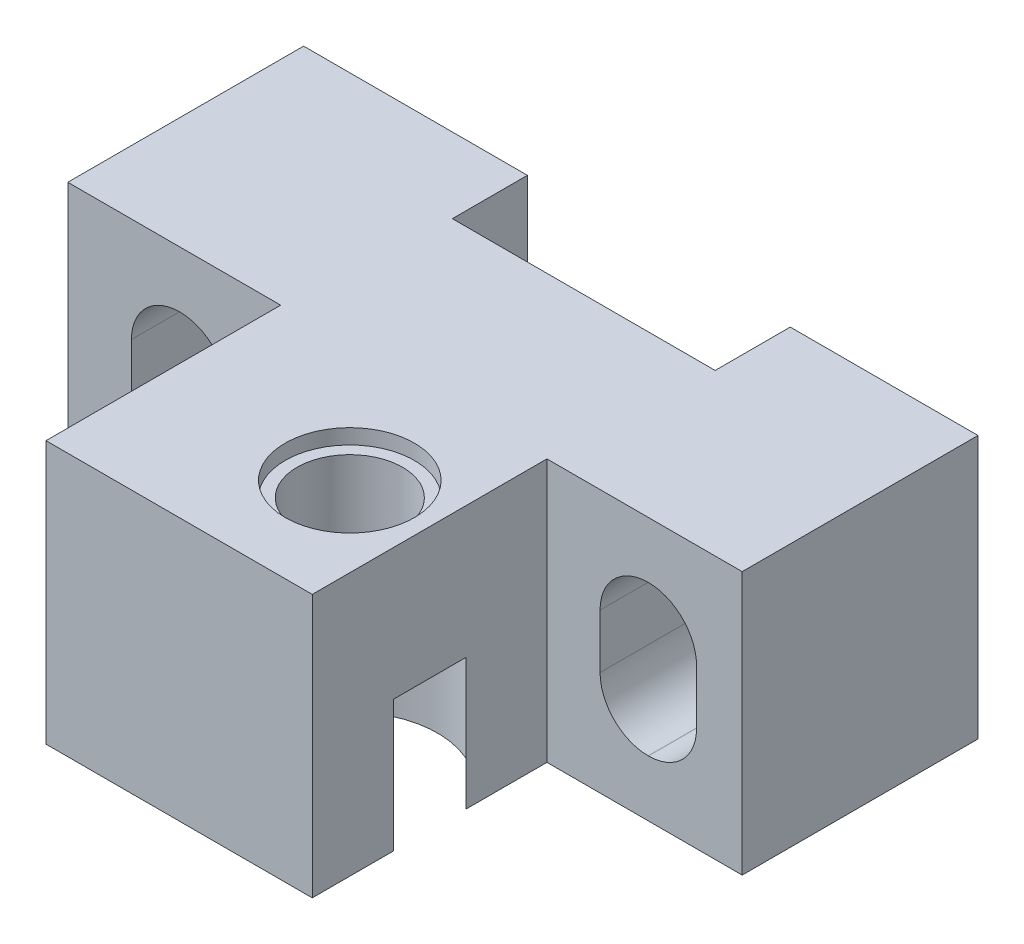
ISO-10303-21;
HEADER;
FILE_DESCRIPTION(('STEP AP214'),'2;1');
FILE_NAME('part.step','',(''),(''),'','','');
FILE_SCHEMA(('AUTOMOTIVE_DESIGN { 1 0 10303 214 1 1 1 1 }'));
ENDSEC;
DATA;
#1=APPLICATION_CONTEXT('core data for automotive mechanical design processes');
#2=APPLICATION_PROTOCOL_DEFINITION('international standard','automotive_design',2000,#1);
#3=PRODUCT_CONTEXT('',#1,'mechanical');
#4=PRODUCT('Part','Part','',(#3));
#5=PRODUCT_RELATED_PRODUCT_CATEGORY('part','',(#4));
#6=PRODUCT_DEFINITION_FORMATION('','',#4);
#7=PRODUCT_DEFINITION_CONTEXT('part definition',#1,'design');
#8=PRODUCT_DEFINITION('design','',#6,#7);
#9=PRODUCT_DEFINITION_SHAPE('','',#8);
#10=(LENGTH_UNIT() NAMED_UNIT(*) SI_UNIT(.MILLI.,.METRE.));
#11=(NAMED_UNIT(*) PLANE_ANGLE_UNIT() SI_UNIT($,.RADIAN.));
#12=(NAMED_UNIT(*) SI_UNIT($,.STERADIAN.) SOLID_ANGLE_UNIT());
#13=UNCERTAINTY_MEASURE_WITH_UNIT(LENGTH_MEASURE(1.E-05),#10,'distance_accuracy_value','');
#14=(GEOMETRIC_REPRESENTATION_CONTEXT(3) GLOBAL_UNCERTAINTY_ASSIGNED_CONTEXT((#13)) GLOBAL_UNIT_ASSIGNED_CONTEXT((#10,
#11,#12)) REPRESENTATION_CONTEXT('',''));
#15=CARTESIAN_POINT('',(0.,0.,0.));
#16=DIRECTION('',(0.,0.,1.));
#17=DIRECTION('',(1.,0.,0.));
#18=AXIS2_PLACEMENT_3D('',#15,#16,#17);
#19=CARTESIAN_POINT('',(0.,-8.89005,11.938));
#20=DIRECTION('',(0.,1.,0.));
#21=DIRECTION('',(0.,0.,1.));
#22=AXIS2_PLACEMENT_3D('',#19,#20,#21);
#23=CYLINDRICAL_SURFACE('',#22,1.78435);
#24=CARTESIAN_POINT('',(0.,-4.445,11.938));
#25=DIRECTION('',(0.,-1.,0.));
#26=DIRECTION('',(0.,0.,-1.));
#27=AXIS2_PLACEMENT_3D('',#24,#25,#26);
#28=CIRCLE('',#27,1.78435);
#29=CARTESIAN_POINT('',(0.,-4.445,10.15365));
#30=VERTEX_POINT('',#29);
#31=EDGE_CURVE('E271',#30,#30,#28,.F.);
#32=ORIENTED_EDGE('',*,*,#31,.F.);
#33=EDGE_LOOP('',(#32));
#34=FACE_BOUND('',#33,.T.);
#35=CARTESIAN_POINT('',(0.,-0.508,11.938));
#36=DIRECTION('',(0.,1.,0.));
#37=DIRECTION('',(0.,0.,1.));
#38=AXIS2_PLACEMENT_3D('',#35,#36,#37);
#39=CIRCLE('',#38,1.78435);
#40=CARTESIAN_POINT('',(0.,-0.508,13.72235));
#41=VERTEX_POINT('',#40);
#42=EDGE_CURVE('E46',#41,#41,#39,.F.);
#43=ORIENTED_EDGE('',*,*,#42,.F.);
#44=EDGE_LOOP('',(#43));
#45=FACE_BOUND('',#44,.T.);
#46=ADVANCED_FACE('F42',(#34,#45),#23,.F.);
#47=CARTESIAN_POINT('',(-13.5001,-8.89,7.9756));
#48=DIRECTION('',(0.,0.,1.));
#49=DIRECTION('',(1.,0.,0.));
#50=AXIS2_PLACEMENT_3D('',#47,#48,#49);
#51=PLANE('',#50);
#52=DIRECTION('',(0.,-1.,0.));
#53=VECTOR('',#52,1.);
#54=CARTESIAN_POINT('',(4.50215,-1.905,7.9756));
#55=LINE('',#54,#53);
#56=CARTESIAN_POINT('',(4.50215,-3.5306,7.9756));
#57=VERTEX_POINT('',#56);
#58=CARTESIAN_POINT('',(4.50215,-5.3594,7.9756));
#59=VERTEX_POINT('',#58);
#60=EDGE_CURVE('E848',#57,#59,#55,.T.);
#61=ORIENTED_EDGE('',*,*,#60,.F.);
#62=CARTESIAN_POINT('',(6.12775,-3.5306,7.9756));
#63=DIRECTION('',(0.,0.,1.));
#64=DIRECTION('',(1.,0.,0.));
#65=AXIS2_PLACEMENT_3D('',#62,#63,#64);
#66=CIRCLE('',#65,1.6256);
#67=CARTESIAN_POINT('',(6.12775,-1.905,7.9756));
#68=VERTEX_POINT('',#67);
#69=EDGE_CURVE('E298',#57,#68,#66,.F.);
#70=ORIENTED_EDGE('',*,*,#69,.T.);
#71=DIRECTION('',(-1.,0.,0.));
#72=VECTOR('',#71,1.);
#73=CARTESIAN_POINT('',(4.50215,-1.905,7.9756));
#74=LINE('',#73,#72);
#75=CARTESIAN_POINT('',(6.14045,-1.905,7.9756));
#76=VERTEX_POINT('',#75);
#77=EDGE_CURVE('E857',#76,#68,#74,.T.);
#78=ORIENTED_EDGE('',*,*,#77,.F.);
#79=CARTESIAN_POINT('',(6.14045,-3.5306,7.9756));
#80=DIRECTION('',(0.,0.,1.));
#81=DIRECTION('',(1.,0.,0.));
#82=AXIS2_PLACEMENT_3D('',#79,#80,#81);
#83=CIRCLE('',#82,1.6256);
#84=CARTESIAN_POINT('',(7.76605,-3.5306,7.9756));
#85=VERTEX_POINT('',#84);
#86=EDGE_CURVE('E302',#76,#85,#83,.F.);
#87=ORIENTED_EDGE('',*,*,#86,.T.);
#88=DIRECTION('',(0.,1.,0.));
#89=VECTOR('',#88,1.);
#90=CARTESIAN_POINT('',(7.76605,-1.905,7.9756));
#91=LINE('',#90,#89);
#92=CARTESIAN_POINT('',(7.76605,-5.3594,7.9756));
#93=VERTEX_POINT('',#92);
#94=EDGE_CURVE('E854',#93,#85,#91,.T.);
#95=ORIENTED_EDGE('',*,*,#94,.F.);
#96=CARTESIAN_POINT('',(6.14045,-5.3594,7.9756));
#97=DIRECTION('',(0.,0.,1.));
#98=DIRECTION('',(1.,0.,0.));
#99=AXIS2_PLACEMENT_3D('',#96,#97,#98);
#100=CIRCLE('',#99,1.6256);
#101=CARTESIAN_POINT('',(6.14045,-6.985,7.9756));
#102=VERTEX_POINT('',#101);
#103=EDGE_CURVE('E306',#93,#102,#100,.F.);
#104=ORIENTED_EDGE('',*,*,#103,.T.);
#105=DIRECTION('',(1.,0.,0.));
#106=VECTOR('',#105,1.);
#107=CARTESIAN_POINT('',(4.50215,-6.985,7.9756));
#108=LINE('',#107,#106);
#109=CARTESIAN_POINT('',(6.12775,-6.985,7.9756));
#110=VERTEX_POINT('',#109);
#111=EDGE_CURVE('E851',#110,#102,#108,.T.);
#112=ORIENTED_EDGE('',*,*,#111,.F.);
#113=CARTESIAN_POINT('',(6.12775,-5.3594,7.9756));
#114=DIRECTION('',(0.,0.,1.));
#115=DIRECTION('',(1.,0.,0.));
#116=AXIS2_PLACEMENT_3D('',#113,#114,#115);
#117=CIRCLE('',#116,1.6256);
#118=EDGE_CURVE('E310',#110,#59,#117,.F.);
#119=ORIENTED_EDGE('',*,*,#118,.T.);
#120=EDGE_LOOP('',(#61,#70,#78,#87,#95,#104,#112,#119));
#121=FACE_BOUND('',#120,.T.);
#122=DIRECTION('',(0.,1.,0.));
#123=VECTOR('',#122,1.);
#124=CARTESIAN_POINT('',(2.7051,0.,7.9756));
#125=LINE('',#124,#123);
#126=CARTESIAN_POINT('',(2.7051,-8.89,7.9756));
#127=VERTEX_POINT('',#126);
#128=CARTESIAN_POINT('',(2.7051,0.,7.9756));
#129=VERTEX_POINT('',#128);
#130=EDGE_CURVE('E451',#127,#129,#125,.T.);
#131=ORIENTED_EDGE('',*,*,#130,.F.);
#132=DIRECTION('',(1.,0.,0.));
#133=VECTOR('',#132,1.);
#134=CARTESIAN_POINT('',(-13.5001,-8.89,7.9756));
#135=LINE('',#134,#133);
#136=CARTESIAN_POINT('',(9.3091,-8.89,7.9756));
#137=VERTEX_POINT('',#136);
#138=EDGE_CURVE('E259',#127,#137,#135,.T.);
#139=ORIENTED_EDGE('',*,*,#138,.T.);
#140=DIRECTION('',(0.,1.,0.));
#141=VECTOR('',#140,1.);
#142=CARTESIAN_POINT('',(9.3091,0.,7.9756));
#143=LINE('',#142,#141);
#144=CARTESIAN_POINT('',(9.3091,0.,7.9756));
#145=VERTEX_POINT('',#144);
#146=EDGE_CURVE('E410',#137,#145,#143,.T.);
#147=ORIENTED_EDGE('',*,*,#146,.T.);
#148=DIRECTION('',(-1.,0.,0.));
#149=VECTOR('',#148,1.);
#150=CARTESIAN_POINT('',(-13.5001,0.,7.9756));
#151=LINE('',#150,#149);
#152=EDGE_CURVE('E428',#145,#129,#151,.T.);
#153=ORIENTED_EDGE('',*,*,#152,.T.);
#154=EDGE_LOOP('',(#131,#139,#147,#153));
#155=FACE_BOUND('',#154,.T.);
#156=ADVANCED_FACE('F441',(#121,#155),#51,.T.);
#157=CARTESIAN_POINT('',(-13.5001,-8.89,0.));
#158=DIRECTION('',(0.,0.,1.));
#159=DIRECTION('',(1.,0.,0.));
#160=AXIS2_PLACEMENT_3D('',#157,#158,#159);
#161=PLANE('',#160);
#162=DIRECTION('',(0.,1.,0.));
#163=VECTOR('',#162,1.);
#164=CARTESIAN_POINT('',(7.76605,-1.905,0.));
#165=LINE('',#164,#163);
#166=CARTESIAN_POINT('',(7.76605,-5.3594,0.));
#167=VERTEX_POINT('',#166);
#168=CARTESIAN_POINT('',(7.76605,-3.5306,0.));
#169=VERTEX_POINT('',#168);
#170=EDGE_CURVE('E865',#167,#169,#165,.T.);
#171=ORIENTED_EDGE('',*,*,#170,.T.);
#172=CARTESIAN_POINT('',(6.14045,-3.5306,0.));
#173=DIRECTION('',(0.,0.,1.));
#174=DIRECTION('',(1.,0.,0.));
#175=AXIS2_PLACEMENT_3D('',#172,#173,#174);
#176=CIRCLE('',#175,1.6256);
#177=CARTESIAN_POINT('',(6.14045,-1.905,0.));
#178=VERTEX_POINT('',#177);
#179=EDGE_CURVE('E304',#169,#178,#176,.T.);
#180=ORIENTED_EDGE('',*,*,#179,.T.);
#181=DIRECTION('',(-1.,0.,0.));
#182=VECTOR('',#181,1.);
#183=CARTESIAN_POINT('',(4.50215,-1.905,0.));
#184=LINE('',#183,#182);
#185=CARTESIAN_POINT('',(6.12775,-1.905,0.));
#186=VERTEX_POINT('',#185);
#187=EDGE_CURVE('E455',#178,#186,#184,.T.);
#188=ORIENTED_EDGE('',*,*,#187,.T.);
#189=CARTESIAN_POINT('',(6.12775,-3.5306,0.));
#190=DIRECTION('',(0.,0.,1.));
#191=DIRECTION('',(1.,0.,0.));
#192=AXIS2_PLACEMENT_3D('',#189,#190,#191);
#193=CIRCLE('',#192,1.6256);
#194=CARTESIAN_POINT('',(4.50215,-3.5306,0.));
#195=VERTEX_POINT('',#194);
#196=EDGE_CURVE('E300',#186,#195,#193,.T.);
#197=ORIENTED_EDGE('',*,*,#196,.T.);
#198=DIRECTION('',(0.,-1.,0.));
#199=VECTOR('',#198,1.);
#200=CARTESIAN_POINT('',(4.50215,-1.905,0.));
#201=LINE('',#200,#199);
#202=CARTESIAN_POINT('',(4.50215,-5.3594,0.));
#203=VERTEX_POINT('',#202);
#204=EDGE_CURVE('E860',#195,#203,#201,.T.);
#205=ORIENTED_EDGE('',*,*,#204,.T.);
#206=CARTESIAN_POINT('',(6.12775,-5.3594,0.));
#207=DIRECTION('',(0.,0.,1.));
#208=DIRECTION('',(1.,0.,0.));
#209=AXIS2_PLACEMENT_3D('',#206,#207,#208);
#210=CIRCLE('',#209,1.6256);
#211=CARTESIAN_POINT('',(6.12775,-6.985,0.));
#212=VERTEX_POINT('',#211);
#213=EDGE_CURVE('E312',#203,#212,#210,.T.);
#214=ORIENTED_EDGE('',*,*,#213,.T.);
#215=DIRECTION('',(1.,0.,0.));
#216=VECTOR('',#215,1.);
#217=CARTESIAN_POINT('',(4.50215,-6.985,0.));
#218=LINE('',#217,#216);
#219=CARTESIAN_POINT('',(6.14045,-6.985,0.));
#220=VERTEX_POINT('',#219);
#221=EDGE_CURVE('E863',#212,#220,#218,.T.);
#222=ORIENTED_EDGE('',*,*,#221,.T.);
#223=CARTESIAN_POINT('',(6.14045,-5.3594,0.));
#224=DIRECTION('',(0.,0.,1.));
#225=DIRECTION('',(1.,0.,0.));
#226=AXIS2_PLACEMENT_3D('',#223,#224,#225);
#227=CIRCLE('',#226,1.6256);
#228=EDGE_CURVE('E308',#220,#167,#227,.T.);
#229=ORIENTED_EDGE('',*,*,#228,.T.);
#230=EDGE_LOOP('',(#171,#180,#188,#197,#205,#214,#222,#229));
#231=FACE_BOUND('',#230,.T.);
#232=DIRECTION('',(1.,0.,0.));
#233=VECTOR('',#232,1.);
#234=CARTESIAN_POINT('',(-13.5001,-8.89,0.));
#235=LINE('',#234,#233);
#236=CARTESIAN_POINT('',(2.9591,-8.89,0.));
#237=VERTEX_POINT('',#236);
#238=CARTESIAN_POINT('',(9.3091,-8.89,0.));
#239=VERTEX_POINT('',#238);
#240=EDGE_CURVE('E395',#237,#239,#235,.T.);
#241=ORIENTED_EDGE('',*,*,#240,.F.);
#242=DIRECTION('',(0.,-1.,0.));
#243=VECTOR('',#242,1.);
#244=CARTESIAN_POINT('',(2.9591,-8.89,0.));
#245=LINE('',#244,#243);
#246=CARTESIAN_POINT('',(2.9591,0.,0.));
#247=VERTEX_POINT('',#246);
#248=EDGE_CURVE('E365',#247,#237,#245,.T.);
#249=ORIENTED_EDGE('',*,*,#248,.F.);
#250=DIRECTION('',(-1.,0.,0.));
#251=VECTOR('',#250,1.);
#252=CARTESIAN_POINT('',(-13.5001,0.,0.));
#253=LINE('',#252,#251);
#254=CARTESIAN_POINT('',(9.3091,0.,0.));
#255=VERTEX_POINT('',#254);
#256=EDGE_CURVE('E402',#255,#247,#253,.T.);
#257=ORIENTED_EDGE('',*,*,#256,.F.);
#258=DIRECTION('',(0.,1.,0.));
#259=VECTOR('',#258,1.);
#260=CARTESIAN_POINT('',(9.3091,0.,0.));
#261=LINE('',#260,#259);
#262=EDGE_CURVE('E399',#239,#255,#261,.T.);
#263=ORIENTED_EDGE('',*,*,#262,.F.);
#264=EDGE_LOOP('',(#241,#249,#257,#263));
#265=FACE_BOUND('',#264,.T.);
#266=ADVANCED_FACE('F492',(#231,#265),#161,.F.);
#267=CARTESIAN_POINT('',(-13.5001,0.,7.9756));
#268=DIRECTION('',(1.,0.,0.));
#269=DIRECTION('',(0.,1.,0.));
#270=AXIS2_PLACEMENT_3D('',#267,#268,#269);
#271=PLANE('',#270);
#272=DIRECTION('',(0.,-1.,0.));
#273=VECTOR('',#272,1.);
#274=CARTESIAN_POINT('',(-13.5001,0.,0.));
#275=LINE('',#274,#273);
#276=CARTESIAN_POINT('',(-13.5001,0.,0.));
#277=VERTEX_POINT('',#276);
#278=CARTESIAN_POINT('',(-13.5001,-8.89,0.));
#279=VERTEX_POINT('',#278);
#280=EDGE_CURVE('E385',#277,#279,#275,.T.);
#281=ORIENTED_EDGE('',*,*,#280,.T.);
#282=DIRECTION('',(0.,0.,-1.));
#283=VECTOR('',#282,1.);
#284=CARTESIAN_POINT('',(-13.5001,-8.89,7.9756));
#285=LINE('',#284,#283);
#286=CARTESIAN_POINT('',(-13.5001,-8.89,7.9756));
#287=VERTEX_POINT('',#286);
#288=EDGE_CURVE('E280',#287,#279,#285,.T.);
#289=ORIENTED_EDGE('',*,*,#288,.F.);
#290=DIRECTION('',(0.,-1.,0.));
#291=VECTOR('',#290,1.);
#292=CARTESIAN_POINT('',(-13.5001,0.,7.9756));
#293=LINE('',#292,#291);
#294=CARTESIAN_POINT('',(-13.5001,0.,7.9756));
#295=VERTEX_POINT('',#294);
#296=EDGE_CURVE('E405',#295,#287,#293,.T.);
#297=ORIENTED_EDGE('',*,*,#296,.F.);
#298=DIRECTION('',(0.,0.,-1.));
#299=VECTOR('',#298,1.);
#300=CARTESIAN_POINT('',(-13.5001,0.,7.9756));
#301=LINE('',#300,#299);
#302=EDGE_CURVE('E426',#295,#277,#301,.T.);
#303=ORIENTED_EDGE('',*,*,#302,.T.);
#304=EDGE_LOOP('',(#281,#289,#297,#303));
#305=FACE_BOUND('',#304,.T.);
#306=ADVANCED_FACE('F44',(#305),#271,.F.);
#307=CARTESIAN_POINT('',(-13.5001,-8.89,7.9756));
#308=DIRECTION('',(0.,1.,0.));
#309=DIRECTION('',(0.,0.,1.));
#310=AXIS2_PLACEMENT_3D('',#307,#308,#309);
#311=PLANE('',#310);
#312=DIRECTION('',(0.,0.,-1.));
#313=VECTOR('',#312,1.);
#314=CARTESIAN_POINT('',(2.7051,-8.89,15.9131));
#315=LINE('',#314,#313);
#316=CARTESIAN_POINT('',(2.7051,-8.89,10.707541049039));
#317=VERTEX_POINT('',#316);
#318=EDGE_CURVE('E253',#317,#127,#315,.T.);
#319=ORIENTED_EDGE('',*,*,#318,.F.);
#320=CARTESIAN_POINT('',(0.,-8.89,11.938));
#321=DIRECTION('',(0.,-1.,0.));
#322=DIRECTION('',(0.,0.,-1.));
#323=AXIS2_PLACEMENT_3D('',#320,#321,#322);
#324=CIRCLE('',#323,2.9718);
#325=CARTESIAN_POINT('',(2.7051,-8.89,13.168458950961));
#326=VERTEX_POINT('',#325);
#327=EDGE_CURVE('E241',#326,#317,#324,.T.);
#328=ORIENTED_EDGE('',*,*,#327,.F.);
#329=CARTESIAN_POINT('',(2.7051,-8.89,15.9131));
#330=VERTEX_POINT('',#329);
#331=EDGE_CURVE('E260',#330,#326,#315,.T.);
#332=ORIENTED_EDGE('',*,*,#331,.F.);
#333=DIRECTION('',(1.,0.,0.));
#334=VECTOR('',#333,1.);
#335=CARTESIAN_POINT('',(2.7051,-8.89,15.9131));
#336=LINE('',#335,#334);
#337=CARTESIAN_POINT('',(-6.3001,-8.89,15.9131));
#338=VERTEX_POINT('',#337);
#339=EDGE_CURVE('E355',#338,#330,#336,.T.);
#340=ORIENTED_EDGE('',*,*,#339,.F.);
#341=DIRECTION('',(0.,0.,-1.));
#342=VECTOR('',#341,1.);
#343=CARTESIAN_POINT('',(-6.3001,-8.89,15.9131));
#344=LINE('',#343,#342);
#345=CARTESIAN_POINT('',(-6.3001,-8.89,7.9756));
#346=VERTEX_POINT('',#345);
#347=EDGE_CURVE('E263',#338,#346,#344,.T.);
#348=ORIENTED_EDGE('',*,*,#347,.T.);
#349=EDGE_CURVE('E416',#287,#346,#135,.T.);
#350=ORIENTED_EDGE('',*,*,#349,.F.);
#351=ORIENTED_EDGE('',*,*,#288,.T.);
#352=CARTESIAN_POINT('',(-5.9309,-8.89,0.));
#353=VERTEX_POINT('',#352);
#354=EDGE_CURVE('E396',#279,#353,#235,.T.);
#355=ORIENTED_EDGE('',*,*,#354,.T.);
#356=DIRECTION('',(0.,0.,-1.));
#357=VECTOR('',#356,1.);
#358=CARTESIAN_POINT('',(-5.9309,-8.89,2.54));
#359=LINE('',#358,#357);
#360=CARTESIAN_POINT('',(-5.9309,-8.89,2.54));
#361=VERTEX_POINT('',#360);
#362=EDGE_CURVE('E389',#361,#353,#359,.T.);
#363=ORIENTED_EDGE('',*,*,#362,.F.);
#364=DIRECTION('',(-1.,0.,0.));
#365=VECTOR('',#364,1.);
#366=CARTESIAN_POINT('',(2.9591,-8.89,2.54));
#367=LINE('',#366,#365);
#368=CARTESIAN_POINT('',(2.9591,-8.89,2.54));
#369=VERTEX_POINT('',#368);
#370=EDGE_CURVE('E373',#369,#361,#367,.T.);
#371=ORIENTED_EDGE('',*,*,#370,.F.);
#372=DIRECTION('',(0.,0.,-1.));
#373=VECTOR('',#372,1.);
#374=CARTESIAN_POINT('',(2.9591,-8.89,2.54));
#375=LINE('',#374,#373);
#376=EDGE_CURVE('E382',#369,#237,#375,.T.);
#377=ORIENTED_EDGE('',*,*,#376,.T.);
#378=ORIENTED_EDGE('',*,*,#240,.T.);
#379=DIRECTION('',(0.,0.,-1.));
#380=VECTOR('',#379,1.);
#381=CARTESIAN_POINT('',(9.3091,-8.89,7.9756));
#382=LINE('',#381,#380);
#383=EDGE_CURVE('E420',#137,#239,#382,.T.);
#384=ORIENTED_EDGE('',*,*,#383,.F.);
#385=ORIENTED_EDGE('',*,*,#138,.F.);
#386=EDGE_LOOP('',(#319,#328,#332,#340,#348,#350,#351,#355,#363,#371,#377,#378,#384,#385));
#387=FACE_BOUND('',#386,.T.);
#388=ADVANCED_FACE('F257',(#387),#311,.F.);
#389=CARTESIAN_POINT('',(9.3091,0.,7.9756));
#390=DIRECTION('',(-1.,0.,0.));
#391=DIRECTION('',(0.,-1.,0.));
#392=AXIS2_PLACEMENT_3D('',#389,#390,#391);
#393=PLANE('',#392);
#394=ORIENTED_EDGE('',*,*,#262,.T.);
#395=DIRECTION('',(0.,0.,-1.));
#396=VECTOR('',#395,1.);
#397=CARTESIAN_POINT('',(9.3091,0.,7.9756));
#398=LINE('',#397,#396);
#399=EDGE_CURVE('E423',#145,#255,#398,.T.);
#400=ORIENTED_EDGE('',*,*,#399,.F.);
#401=ORIENTED_EDGE('',*,*,#146,.F.);
#402=ORIENTED_EDGE('',*,*,#383,.T.);
#403=EDGE_LOOP('',(#394,#400,#401,#402));
#404=FACE_BOUND('',#403,.T.);
#405=ADVANCED_FACE('F443',(#404),#393,.F.);
#406=CARTESIAN_POINT('',(-13.5001,0.,7.9756));
#407=DIRECTION('',(0.,-1.,0.));
#408=DIRECTION('',(0.,0.,-1.));
#409=AXIS2_PLACEMENT_3D('',#406,#407,#408);
#410=PLANE('',#409);
#411=CARTESIAN_POINT('',(0.,0.,11.938));
#412=DIRECTION('',(0.,1.,0.));
#413=DIRECTION('',(0.,0.,1.));
#414=AXIS2_PLACEMENT_3D('',#411,#412,#413);
#415=CIRCLE('',#414,2.1844);
#416=CARTESIAN_POINT('',(0.,0.,14.1224));
#417=VERTEX_POINT('',#416);
#418=EDGE_CURVE('E902',#417,#417,#415,.T.);
#419=ORIENTED_EDGE('',*,*,#418,.F.);
#420=EDGE_LOOP('',(#419));
#421=FACE_BOUND('',#420,.T.);
#422=ORIENTED_EDGE('',*,*,#256,.T.);
#423=DIRECTION('',(0.,0.,-1.));
#424=VECTOR('',#423,1.);
#425=CARTESIAN_POINT('',(2.9591,0.,2.54));
#426=LINE('',#425,#424);
#427=CARTESIAN_POINT('',(2.9591,0.,2.54));
#428=VERTEX_POINT('',#427);
#429=EDGE_CURVE('E383',#428,#247,#426,.T.);
#430=ORIENTED_EDGE('',*,*,#429,.F.);
#431=DIRECTION('',(1.,0.,0.));
#432=VECTOR('',#431,1.);
#433=CARTESIAN_POINT('',(2.9591,0.,2.54));
#434=LINE('',#433,#432);
#435=CARTESIAN_POINT('',(-5.9309,0.,2.54));
#436=VERTEX_POINT('',#435);
#437=EDGE_CURVE('E379',#436,#428,#434,.T.);
#438=ORIENTED_EDGE('',*,*,#437,.F.);
#439=DIRECTION('',(0.,0.,-1.));
#440=VECTOR('',#439,1.);
#441=CARTESIAN_POINT('',(-5.9309,0.,2.54));
#442=LINE('',#441,#440);
#443=CARTESIAN_POINT('',(-5.9309,0.,0.));
#444=VERTEX_POINT('',#443);
#445=EDGE_CURVE('E386',#436,#444,#442,.T.);
#446=ORIENTED_EDGE('',*,*,#445,.T.);
#447=EDGE_CURVE('E401',#444,#277,#253,.T.);
#448=ORIENTED_EDGE('',*,*,#447,.T.);
#449=ORIENTED_EDGE('',*,*,#302,.F.);
#450=CARTESIAN_POINT('',(-6.3001,0.,7.9756));
#451=VERTEX_POINT('',#450);
#452=EDGE_CURVE('E432',#451,#295,#151,.T.);
#453=ORIENTED_EDGE('',*,*,#452,.F.);
#454=DIRECTION('',(0.,0.,-1.));
#455=VECTOR('',#454,1.);
#456=CARTESIAN_POINT('',(-6.3001,0.,15.9131));
#457=LINE('',#456,#455);
#458=CARTESIAN_POINT('',(-6.3001,0.,15.9131));
#459=VERTEX_POINT('',#458);
#460=EDGE_CURVE('E368',#459,#451,#457,.T.);
#461=ORIENTED_EDGE('',*,*,#460,.F.);
#462=DIRECTION('',(-1.,0.,0.));
#463=VECTOR('',#462,1.);
#464=CARTESIAN_POINT('',(-6.3001,0.,15.9131));
#465=LINE('',#464,#463);
#466=CARTESIAN_POINT('',(2.7051,0.,15.9131));
#467=VERTEX_POINT('',#466);
#468=EDGE_CURVE('E361',#467,#459,#465,.T.);
#469=ORIENTED_EDGE('',*,*,#468,.F.);
#470=DIRECTION('',(0.,0.,-1.));
#471=VECTOR('',#470,1.);
#472=CARTESIAN_POINT('',(2.7051,0.,15.9131));
#473=LINE('',#472,#471);
#474=EDGE_CURVE('E261',#467,#129,#473,.T.);
#475=ORIENTED_EDGE('',*,*,#474,.T.);
#476=ORIENTED_EDGE('',*,*,#152,.F.);
#477=ORIENTED_EDGE('',*,*,#399,.T.);
#478=EDGE_LOOP('',(#422,#430,#438,#446,#448,#449,#453,#461,#469,#475,#476,#477));
#479=FACE_BOUND('',#478,.T.);
#480=ADVANCED_FACE('F447',(#421,#479),#410,.F.);
#481=DIRECTION('',(0.,-1.,0.));
#482=VECTOR('',#481,1.);
#483=CARTESIAN_POINT('',(-11.34745,-1.905,7.9756));
#484=LINE('',#483,#482);
#485=CARTESIAN_POINT('',(-11.34745,-3.5306,7.9756));
#486=VERTEX_POINT('',#485);
#487=CARTESIAN_POINT('',(-11.34745,-5.3594,7.9756));
#488=VERTEX_POINT('',#487);
#489=EDGE_CURVE('E823',#486,#488,#484,.T.);
#490=ORIENTED_EDGE('',*,*,#489,.F.);
#491=CARTESIAN_POINT('',(-9.72185,-3.5306,7.9756));
#492=DIRECTION('',(0.,0.,1.));
#493=DIRECTION('',(1.,0.,0.));
#494=AXIS2_PLACEMENT_3D('',#491,#492,#493);
#495=CIRCLE('',#494,1.6256);
#496=CARTESIAN_POINT('',(-9.72185,-1.905,7.9756));
#497=VERTEX_POINT('',#496);
#498=EDGE_CURVE('E345',#486,#497,#495,.F.);
#499=ORIENTED_EDGE('',*,*,#498,.T.);
#500=DIRECTION('',(-1.,0.,0.));
#501=VECTOR('',#500,1.);
#502=CARTESIAN_POINT('',(-11.34745,-1.905,7.9756));
#503=LINE('',#502,#501);
#504=CARTESIAN_POINT('',(-9.70915,-1.905,7.9756));
#505=VERTEX_POINT('',#504);
#506=EDGE_CURVE('E836',#505,#497,#503,.T.);
#507=ORIENTED_EDGE('',*,*,#506,.F.);
#508=CARTESIAN_POINT('',(-9.70915,-3.5306,7.9756));
#509=DIRECTION('',(0.,0.,1.));
#510=DIRECTION('',(1.,0.,0.));
#511=AXIS2_PLACEMENT_3D('',#508,#509,#510);
#512=CIRCLE('',#511,1.6256);
#513=CARTESIAN_POINT('',(-8.08355,-3.5306,7.9756));
#514=VERTEX_POINT('',#513);
#515=EDGE_CURVE('E341',#505,#514,#512,.F.);
#516=ORIENTED_EDGE('',*,*,#515,.T.);
#517=DIRECTION('',(0.,1.,0.));
#518=VECTOR('',#517,1.);
#519=CARTESIAN_POINT('',(-8.08355,-1.905,7.9756));
#520=LINE('',#519,#518);
#521=CARTESIAN_POINT('',(-8.08355,-5.3594,7.9756));
#522=VERTEX_POINT('',#521);
#523=EDGE_CURVE('E830',#522,#514,#520,.T.);
#524=ORIENTED_EDGE('',*,*,#523,.F.);
#525=CARTESIAN_POINT('',(-9.70915,-5.3594,7.9756));
#526=DIRECTION('',(0.,0.,1.));
#527=DIRECTION('',(1.,0.,0.));
#528=AXIS2_PLACEMENT_3D('',#525,#526,#527);
#529=CIRCLE('',#528,1.6256);
#530=CARTESIAN_POINT('',(-9.70915,-6.985,7.9756));
#531=VERTEX_POINT('',#530);
#532=EDGE_CURVE('E337',#522,#531,#529,.F.);
#533=ORIENTED_EDGE('',*,*,#532,.T.);
#534=DIRECTION('',(1.,0.,0.));
#535=VECTOR('',#534,1.);
#536=CARTESIAN_POINT('',(-11.34745,-6.985,7.9756));
#537=LINE('',#536,#535);
#538=CARTESIAN_POINT('',(-9.72185,-6.985,7.9756));
#539=VERTEX_POINT('',#538);
#540=EDGE_CURVE('E827',#539,#531,#537,.T.);
#541=ORIENTED_EDGE('',*,*,#540,.F.);
#542=CARTESIAN_POINT('',(-9.72185,-5.3594,7.9756));
#543=DIRECTION('',(0.,0.,1.));
#544=DIRECTION('',(1.,0.,0.));
#545=AXIS2_PLACEMENT_3D('',#542,#543,#544);
#546=CIRCLE('',#545,1.6256);
#547=EDGE_CURVE('E333',#539,#488,#546,.F.);
#548=ORIENTED_EDGE('',*,*,#547,.T.);
#549=EDGE_LOOP('',(#490,#499,#507,#516,#524,#533,#541,#548));
#550=FACE_BOUND('',#549,.T.);
#551=DIRECTION('',(0.,-1.,0.));
#552=VECTOR('',#551,1.);
#553=CARTESIAN_POINT('',(-6.3001,-8.89,7.9756));
#554=LINE('',#553,#552);
#555=EDGE_CURVE('E452',#451,#346,#554,.T.);
#556=ORIENTED_EDGE('',*,*,#555,.F.);
#557=ORIENTED_EDGE('',*,*,#452,.T.);
#558=ORIENTED_EDGE('',*,*,#296,.T.);
#559=ORIENTED_EDGE('',*,*,#349,.T.);
#560=EDGE_LOOP('',(#556,#557,#558,#559));
#561=FACE_BOUND('',#560,.T.);
#562=ADVANCED_FACE('F476',(#550,#561),#51,.T.);
#563=DIRECTION('',(0.,1.,0.));
#564=VECTOR('',#563,1.);
#565=CARTESIAN_POINT('',(-8.08355,-1.905,0.));
#566=LINE('',#565,#564);
#567=CARTESIAN_POINT('',(-8.08355,-5.3594,0.));
#568=VERTEX_POINT('',#567);
#569=CARTESIAN_POINT('',(-8.08355,-3.5306,0.));
#570=VERTEX_POINT('',#569);
#571=EDGE_CURVE('E843',#568,#570,#566,.T.);
#572=ORIENTED_EDGE('',*,*,#571,.T.);
#573=CARTESIAN_POINT('',(-9.70915,-3.5306,0.));
#574=DIRECTION('',(0.,0.,1.));
#575=DIRECTION('',(1.,0.,0.));
#576=AXIS2_PLACEMENT_3D('',#573,#574,#575);
#577=CIRCLE('',#576,1.6256);
#578=CARTESIAN_POINT('',(-9.70915,-1.905,0.));
#579=VERTEX_POINT('',#578);
#580=EDGE_CURVE('E343',#570,#579,#577,.T.);
#581=ORIENTED_EDGE('',*,*,#580,.T.);
#582=DIRECTION('',(-1.,0.,0.));
#583=VECTOR('',#582,1.);
#584=CARTESIAN_POINT('',(-11.34745,-1.905,0.));
#585=LINE('',#584,#583);
#586=CARTESIAN_POINT('',(-9.72185,-1.905,0.));
#587=VERTEX_POINT('',#586);
#588=EDGE_CURVE('E846',#579,#587,#585,.T.);
#589=ORIENTED_EDGE('',*,*,#588,.T.);
#590=CARTESIAN_POINT('',(-9.72185,-3.5306,0.));
#591=DIRECTION('',(0.,0.,1.));
#592=DIRECTION('',(1.,0.,0.));
#593=AXIS2_PLACEMENT_3D('',#590,#591,#592);
#594=CIRCLE('',#593,1.6256);
#595=CARTESIAN_POINT('',(-11.34745,-3.5306,0.));
#596=VERTEX_POINT('',#595);
#597=EDGE_CURVE('E346',#587,#596,#594,.T.);
#598=ORIENTED_EDGE('',*,*,#597,.T.);
#599=DIRECTION('',(0.,-1.,0.));
#600=VECTOR('',#599,1.);
#601=CARTESIAN_POINT('',(-11.34745,-1.905,0.));
#602=LINE('',#601,#600);
#603=CARTESIAN_POINT('',(-11.34745,-5.3594,0.));
#604=VERTEX_POINT('',#603);
#605=EDGE_CURVE('E838',#596,#604,#602,.T.);
#606=ORIENTED_EDGE('',*,*,#605,.T.);
#607=CARTESIAN_POINT('',(-9.72185,-5.3594,0.));
#608=DIRECTION('',(0.,0.,1.));
#609=DIRECTION('',(1.,0.,0.));
#610=AXIS2_PLACEMENT_3D('',#607,#608,#609);
#611=CIRCLE('',#610,1.6256);
#612=CARTESIAN_POINT('',(-9.72185,-6.985,0.));
#613=VERTEX_POINT('',#612);
#614=EDGE_CURVE('E335',#604,#613,#611,.T.);
#615=ORIENTED_EDGE('',*,*,#614,.T.);
#616=DIRECTION('',(1.,0.,0.));
#617=VECTOR('',#616,1.);
#618=CARTESIAN_POINT('',(-11.34745,-6.985,0.));
#619=LINE('',#618,#617);
#620=CARTESIAN_POINT('',(-9.70915,-6.985,0.));
#621=VERTEX_POINT('',#620);
#622=EDGE_CURVE('E840',#613,#621,#619,.T.);
#623=ORIENTED_EDGE('',*,*,#622,.T.);
#624=CARTESIAN_POINT('',(-9.70915,-5.3594,0.));
#625=DIRECTION('',(0.,0.,1.));
#626=DIRECTION('',(1.,0.,0.));
#627=AXIS2_PLACEMENT_3D('',#624,#625,#626);
#628=CIRCLE('',#627,1.6256);
#629=EDGE_CURVE('E339',#621,#568,#628,.T.);
#630=ORIENTED_EDGE('',*,*,#629,.T.);
#631=EDGE_LOOP('',(#572,#581,#589,#598,#606,#615,#623,#630));
#632=FACE_BOUND('',#631,.T.);
#633=ORIENTED_EDGE('',*,*,#447,.F.);
#634=DIRECTION('',(0.,1.,0.));
#635=VECTOR('',#634,1.);
#636=CARTESIAN_POINT('',(-5.9309,-8.89,0.));
#637=LINE('',#636,#635);
#638=EDGE_CURVE('E367',#353,#444,#637,.T.);
#639=ORIENTED_EDGE('',*,*,#638,.F.);
#640=ORIENTED_EDGE('',*,*,#354,.F.);
#641=ORIENTED_EDGE('',*,*,#280,.F.);
#642=EDGE_LOOP('',(#633,#639,#640,#641));
#643=FACE_BOUND('',#642,.T.);
#644=ADVANCED_FACE('F479',(#632,#643),#161,.F.);
#645=CARTESIAN_POINT('',(2.9591,-8.89,2.54));
#646=DIRECTION('',(1.,0.,0.));
#647=DIRECTION('',(0.,1.,0.));
#648=AXIS2_PLACEMENT_3D('',#645,#646,#647);
#649=PLANE('',#648);
#650=ORIENTED_EDGE('',*,*,#248,.T.);
#651=ORIENTED_EDGE('',*,*,#376,.F.);
#652=DIRECTION('',(0.,-1.,0.));
#653=VECTOR('',#652,1.);
#654=CARTESIAN_POINT('',(2.9591,-8.89,2.54));
#655=LINE('',#654,#653);
#656=EDGE_CURVE('E370',#428,#369,#655,.T.);
#657=ORIENTED_EDGE('',*,*,#656,.F.);
#658=ORIENTED_EDGE('',*,*,#429,.T.);
#659=EDGE_LOOP('',(#650,#651,#657,#658));
#660=FACE_BOUND('',#659,.T.);
#661=ADVANCED_FACE('F493',(#660),#649,.F.);
#662=CARTESIAN_POINT('',(-5.9309,-8.89,2.54));
#663=DIRECTION('',(-1.,0.,0.));
#664=DIRECTION('',(0.,0.,1.));
#665=AXIS2_PLACEMENT_3D('',#662,#663,#664);
#666=PLANE('',#665);
#667=ORIENTED_EDGE('',*,*,#638,.T.);
#668=ORIENTED_EDGE('',*,*,#445,.F.);
#669=DIRECTION('',(0.,1.,0.));
#670=VECTOR('',#669,1.);
#671=CARTESIAN_POINT('',(-5.9309,-8.89,2.54));
#672=LINE('',#671,#670);
#673=EDGE_CURVE('E376',#361,#436,#672,.T.);
#674=ORIENTED_EDGE('',*,*,#673,.F.);
#675=ORIENTED_EDGE('',*,*,#362,.T.);
#676=EDGE_LOOP('',(#667,#668,#674,#675));
#677=FACE_BOUND('',#676,.T.);
#678=ADVANCED_FACE('F482',(#677),#666,.F.);
#679=CARTESIAN_POINT('',(2.9591,0.,2.54));
#680=DIRECTION('',(0.,0.,1.));
#681=DIRECTION('',(1.,0.,0.));
#682=AXIS2_PLACEMENT_3D('',#679,#680,#681);
#683=PLANE('',#682);
#684=ORIENTED_EDGE('',*,*,#656,.T.);
#685=ORIENTED_EDGE('',*,*,#370,.T.);
#686=ORIENTED_EDGE('',*,*,#673,.T.);
#687=ORIENTED_EDGE('',*,*,#437,.T.);
#688=EDGE_LOOP('',(#684,#685,#686,#687));
#689=FACE_BOUND('',#688,.T.);
#690=ADVANCED_FACE('F486',(#689),#683,.F.);
#691=CARTESIAN_POINT('',(-6.3001,-8.89,15.9131));
#692=DIRECTION('',(1.,0.,0.));
#693=DIRECTION('',(0.,0.,-1.));
#694=AXIS2_PLACEMENT_3D('',#691,#692,#693);
#695=PLANE('',#694);
#696=ORIENTED_EDGE('',*,*,#555,.T.);
#697=ORIENTED_EDGE('',*,*,#347,.F.);
#698=DIRECTION('',(0.,-1.,0.));
#699=VECTOR('',#698,1.);
#700=CARTESIAN_POINT('',(-6.3001,-8.89,15.9131));
#701=LINE('',#700,#699);
#702=EDGE_CURVE('E358',#459,#338,#701,.T.);
#703=ORIENTED_EDGE('',*,*,#702,.F.);
#704=ORIENTED_EDGE('',*,*,#460,.T.);
#705=EDGE_LOOP('',(#696,#697,#703,#704));
#706=FACE_BOUND('',#705,.T.);
#707=ADVANCED_FACE('F470',(#706),#695,.F.);
#708=CARTESIAN_POINT('',(2.7051,0.,15.9131));
#709=DIRECTION('',(-1.,0.,0.));
#710=DIRECTION('',(0.,-1.,0.));
#711=AXIS2_PLACEMENT_3D('',#708,#709,#710);
#712=PLANE('',#711);
#713=DIRECTION('',(0.,0.,1.));
#714=VECTOR('',#713,1.);
#715=CARTESIAN_POINT('',(2.7051,-4.445,15.9131));
#716=LINE('',#715,#714);
#717=CARTESIAN_POINT('',(2.7051,-4.445,10.707541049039));
#718=VERTEX_POINT('',#717);
#719=CARTESIAN_POINT('',(2.7051,-4.445,13.168458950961));
#720=VERTEX_POINT('',#719);
#721=EDGE_CURVE('E255',#718,#720,#716,.T.);
#722=ORIENTED_EDGE('',*,*,#721,.F.);
#723=DIRECTION('',(0.,-1.,0.));
#724=VECTOR('',#723,1.);
#725=CARTESIAN_POINT('',(2.7051,-4.445,10.707541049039));
#726=LINE('',#725,#724);
#727=EDGE_CURVE('E13',#718,#317,#726,.T.);
#728=ORIENTED_EDGE('',*,*,#727,.T.);
#729=ORIENTED_EDGE('',*,*,#318,.T.);
#730=ORIENTED_EDGE('',*,*,#130,.T.);
#731=ORIENTED_EDGE('',*,*,#474,.F.);
#732=DIRECTION('',(0.,1.,0.));
#733=VECTOR('',#732,1.);
#734=CARTESIAN_POINT('',(2.7051,0.,15.9131));
#735=LINE('',#734,#733);
#736=EDGE_CURVE('E266',#330,#467,#735,.T.);
#737=ORIENTED_EDGE('',*,*,#736,.F.);
#738=ORIENTED_EDGE('',*,*,#331,.T.);
#739=DIRECTION('',(0.,-1.,0.));
#740=VECTOR('',#739,1.);
#741=CARTESIAN_POINT('',(2.7051,-4.445,13.168458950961));
#742=LINE('',#741,#740);
#743=EDGE_CURVE('E51',#326,#720,#742,.F.);
#744=ORIENTED_EDGE('',*,*,#743,.T.);
#745=EDGE_LOOP('',(#722,#728,#729,#730,#731,#737,#738,#744));
#746=FACE_BOUND('',#745,.T.);
#747=ADVANCED_FACE('F251',(#746),#712,.F.);
#748=CARTESIAN_POINT('',(-6.3001,0.,15.9131));
#749=DIRECTION('',(0.,0.,1.));
#750=DIRECTION('',(1.,0.,0.));
#751=AXIS2_PLACEMENT_3D('',#748,#749,#750);
#752=PLANE('',#751);
#753=ORIENTED_EDGE('',*,*,#468,.T.);
#754=ORIENTED_EDGE('',*,*,#702,.T.);
#755=ORIENTED_EDGE('',*,*,#339,.T.);
#756=ORIENTED_EDGE('',*,*,#736,.T.);
#757=EDGE_LOOP('',(#753,#754,#755,#756));
#758=FACE_BOUND('',#757,.T.);
#759=ADVANCED_FACE('F577',(#758),#752,.T.);
#760=CARTESIAN_POINT('',(4.50215,-1.905,0.));
#761=DIRECTION('',(-1.,0.,0.));
#762=DIRECTION('',(0.,0.,1.));
#763=AXIS2_PLACEMENT_3D('',#760,#761,#762);
#764=PLANE('',#763);
#765=ORIENTED_EDGE('',*,*,#204,.F.);
#766=DIRECTION('',(0.,0.,1.));
#767=VECTOR('',#766,1.);
#768=CARTESIAN_POINT('',(4.50215,-3.5306,7.9756));
#769=LINE('',#768,#767);
#770=EDGE_CURVE('E279',#195,#57,#769,.T.);
#771=ORIENTED_EDGE('',*,*,#770,.T.);
#772=ORIENTED_EDGE('',*,*,#60,.T.);
#773=DIRECTION('',(0.,0.,1.));
#774=VECTOR('',#773,1.);
#775=CARTESIAN_POINT('',(4.50215,-5.3594,0.));
#776=LINE('',#775,#774);
#777=EDGE_CURVE('E276',#59,#203,#776,.F.);
#778=ORIENTED_EDGE('',*,*,#777,.T.);
#779=EDGE_LOOP('',(#765,#771,#772,#778));
#780=FACE_BOUND('',#779,.T.);
#781=ADVANCED_FACE('F567',(#780),#764,.F.);
#782=CARTESIAN_POINT('',(4.50215,-1.905,0.));
#783=DIRECTION('',(0.,1.,0.));
#784=DIRECTION('',(-1.,0.,0.));
#785=AXIS2_PLACEMENT_3D('',#782,#783,#784);
#786=PLANE('',#785);
#787=ORIENTED_EDGE('',*,*,#77,.T.);
#788=DIRECTION('',(0.,0.,1.));
#789=VECTOR('',#788,1.);
#790=CARTESIAN_POINT('',(6.12775,-1.905,0.));
#791=LINE('',#790,#789);
#792=EDGE_CURVE('E286',#68,#186,#791,.F.);
#793=ORIENTED_EDGE('',*,*,#792,.T.);
#794=ORIENTED_EDGE('',*,*,#187,.F.);
#795=DIRECTION('',(0.,0.,1.));
#796=VECTOR('',#795,1.);
#797=CARTESIAN_POINT('',(6.14045,-1.905,7.9756));
#798=LINE('',#797,#796);
#799=EDGE_CURVE('E283',#178,#76,#798,.T.);
#800=ORIENTED_EDGE('',*,*,#799,.T.);
#801=EDGE_LOOP('',(#787,#793,#794,#800));
#802=FACE_BOUND('',#801,.T.);
#803=ADVANCED_FACE('F563',(#802),#786,.F.);
#804=CARTESIAN_POINT('',(7.76605,-1.905,0.));
#805=DIRECTION('',(1.,0.,0.));
#806=DIRECTION('',(0.,0.,-1.));
#807=AXIS2_PLACEMENT_3D('',#804,#805,#806);
#808=PLANE('',#807);
#809=ORIENTED_EDGE('',*,*,#94,.T.);
#810=DIRECTION('',(0.,0.,1.));
#811=VECTOR('',#810,1.);
#812=CARTESIAN_POINT('',(7.76605,-3.5306,0.));
#813=LINE('',#812,#811);
#814=EDGE_CURVE('E291',#85,#169,#813,.F.);
#815=ORIENTED_EDGE('',*,*,#814,.T.);
#816=ORIENTED_EDGE('',*,*,#170,.F.);
#817=DIRECTION('',(0.,0.,1.));
#818=VECTOR('',#817,1.);
#819=CARTESIAN_POINT('',(7.76605,-5.3594,7.9756));
#820=LINE('',#819,#818);
#821=EDGE_CURVE('E288',#167,#93,#820,.T.);
#822=ORIENTED_EDGE('',*,*,#821,.T.);
#823=EDGE_LOOP('',(#809,#815,#816,#822));
#824=FACE_BOUND('',#823,.T.);
#825=ADVANCED_FACE('F566',(#824),#808,.F.);
#826=CARTESIAN_POINT('',(4.50215,-6.985,0.));
#827=DIRECTION('',(0.,-1.,0.));
#828=DIRECTION('',(1.,0.,0.));
#829=AXIS2_PLACEMENT_3D('',#826,#827,#828);
#830=PLANE('',#829);
#831=ORIENTED_EDGE('',*,*,#111,.T.);
#832=DIRECTION('',(0.,0.,1.));
#833=VECTOR('',#832,1.);
#834=CARTESIAN_POINT('',(6.14045,-6.985,0.));
#835=LINE('',#834,#833);
#836=EDGE_CURVE('E296',#102,#220,#835,.F.);
#837=ORIENTED_EDGE('',*,*,#836,.T.);
#838=ORIENTED_EDGE('',*,*,#221,.F.);
#839=DIRECTION('',(0.,0.,1.));
#840=VECTOR('',#839,1.);
#841=CARTESIAN_POINT('',(6.12775,-6.985,7.9756));
#842=LINE('',#841,#840);
#843=EDGE_CURVE('E293',#212,#110,#842,.T.);
#844=ORIENTED_EDGE('',*,*,#843,.T.);
#845=EDGE_LOOP('',(#831,#837,#838,#844));
#846=FACE_BOUND('',#845,.T.);
#847=ADVANCED_FACE('F561',(#846),#830,.F.);
#848=CARTESIAN_POINT('',(6.12775,-3.5306,0.));
#849=DIRECTION('',(0.,0.,-1.));
#850=DIRECTION('',(-1.,0.,0.));
#851=AXIS2_PLACEMENT_3D('',#848,#849,#850);
#852=CYLINDRICAL_SURFACE('',#851,1.6256);
#853=ORIENTED_EDGE('',*,*,#196,.F.);
#854=ORIENTED_EDGE('',*,*,#792,.F.);
#855=ORIENTED_EDGE('',*,*,#69,.F.);
#856=ORIENTED_EDGE('',*,*,#770,.F.);
#857=EDGE_LOOP('',(#853,#854,#855,#856));
#858=FACE_BOUND('',#857,.T.);
#859=ADVANCED_FACE('F557',(#858),#852,.F.);
#860=CARTESIAN_POINT('',(6.14045,-3.5306,0.));
#861=DIRECTION('',(0.,0.,-1.));
#862=DIRECTION('',(-1.,0.,0.));
#863=AXIS2_PLACEMENT_3D('',#860,#861,#862);
#864=CYLINDRICAL_SURFACE('',#863,1.6256);
#865=ORIENTED_EDGE('',*,*,#179,.F.);
#866=ORIENTED_EDGE('',*,*,#814,.F.);
#867=ORIENTED_EDGE('',*,*,#86,.F.);
#868=ORIENTED_EDGE('',*,*,#799,.F.);
#869=EDGE_LOOP('',(#865,#866,#867,#868));
#870=FACE_BOUND('',#869,.T.);
#871=ADVANCED_FACE('F553',(#870),#864,.F.);
#872=CARTESIAN_POINT('',(6.14045,-5.3594,0.));
#873=DIRECTION('',(0.,0.,-1.));
#874=DIRECTION('',(-1.,0.,0.));
#875=AXIS2_PLACEMENT_3D('',#872,#873,#874);
#876=CYLINDRICAL_SURFACE('',#875,1.6256);
#877=ORIENTED_EDGE('',*,*,#228,.F.);
#878=ORIENTED_EDGE('',*,*,#836,.F.);
#879=ORIENTED_EDGE('',*,*,#103,.F.);
#880=ORIENTED_EDGE('',*,*,#821,.F.);
#881=EDGE_LOOP('',(#877,#878,#879,#880));
#882=FACE_BOUND('',#881,.T.);
#883=ADVANCED_FACE('F549',(#882),#876,.F.);
#884=CARTESIAN_POINT('',(6.12775,-5.3594,0.));
#885=DIRECTION('',(0.,0.,-1.));
#886=DIRECTION('',(-1.,0.,0.));
#887=AXIS2_PLACEMENT_3D('',#884,#885,#886);
#888=CYLINDRICAL_SURFACE('',#887,1.6256);
#889=ORIENTED_EDGE('',*,*,#213,.F.);
#890=ORIENTED_EDGE('',*,*,#777,.F.);
#891=ORIENTED_EDGE('',*,*,#118,.F.);
#892=ORIENTED_EDGE('',*,*,#843,.F.);
#893=EDGE_LOOP('',(#889,#890,#891,#892));
#894=FACE_BOUND('',#893,.T.);
#895=ADVANCED_FACE('F545',(#894),#888,.F.);
#896=CARTESIAN_POINT('',(-11.34745,-1.905,0.));
#897=DIRECTION('',(-1.,0.,0.));
#898=DIRECTION('',(0.,-1.,0.));
#899=AXIS2_PLACEMENT_3D('',#896,#897,#898);
#900=PLANE('',#899);
#901=ORIENTED_EDGE('',*,*,#489,.T.);
#902=DIRECTION('',(0.,0.,1.));
#903=VECTOR('',#902,1.);
#904=CARTESIAN_POINT('',(-11.34745,-5.3594,0.));
#905=LINE('',#904,#903);
#906=EDGE_CURVE('E322',#488,#604,#905,.F.);
#907=ORIENTED_EDGE('',*,*,#906,.T.);
#908=ORIENTED_EDGE('',*,*,#605,.F.);
#909=DIRECTION('',(0.,0.,1.));
#910=VECTOR('',#909,1.);
#911=CARTESIAN_POINT('',(-11.34745,-3.5306,7.9756));
#912=LINE('',#911,#910);
#913=EDGE_CURVE('E319',#596,#486,#912,.T.);
#914=ORIENTED_EDGE('',*,*,#913,.T.);
#915=EDGE_LOOP('',(#901,#907,#908,#914));
#916=FACE_BOUND('',#915,.T.);
#917=ADVANCED_FACE('F536',(#916),#900,.F.);
#918=CARTESIAN_POINT('',(-11.34745,-1.905,0.));
#919=DIRECTION('',(0.,1.,0.));
#920=DIRECTION('',(-1.,0.,0.));
#921=AXIS2_PLACEMENT_3D('',#918,#919,#920);
#922=PLANE('',#921);
#923=ORIENTED_EDGE('',*,*,#588,.F.);
#924=DIRECTION('',(0.,0.,1.));
#925=VECTOR('',#924,1.);
#926=CARTESIAN_POINT('',(-9.70915,-1.905,7.9756));
#927=LINE('',#926,#925);
#928=EDGE_CURVE('E330',#579,#505,#927,.T.);
#929=ORIENTED_EDGE('',*,*,#928,.T.);
#930=ORIENTED_EDGE('',*,*,#506,.T.);
#931=DIRECTION('',(0.,0.,1.));
#932=VECTOR('',#931,1.);
#933=CARTESIAN_POINT('',(-9.72185,-1.905,0.));
#934=LINE('',#933,#932);
#935=EDGE_CURVE('E65',#497,#587,#934,.F.);
#936=ORIENTED_EDGE('',*,*,#935,.T.);
#937=EDGE_LOOP('',(#923,#929,#930,#936));
#938=FACE_BOUND('',#937,.T.);
#939=ADVANCED_FACE('F532',(#938),#922,.F.);
#940=CARTESIAN_POINT('',(-8.08355,-1.905,0.));
#941=DIRECTION('',(1.,0.,0.));
#942=DIRECTION('',(0.,1.,0.));
#943=AXIS2_PLACEMENT_3D('',#940,#941,#942);
#944=PLANE('',#943);
#945=ORIENTED_EDGE('',*,*,#571,.F.);
#946=DIRECTION('',(0.,0.,1.));
#947=VECTOR('',#946,1.);
#948=CARTESIAN_POINT('',(-8.08355,-5.3594,7.9756));
#949=LINE('',#948,#947);
#950=EDGE_CURVE('E326',#568,#522,#949,.T.);
#951=ORIENTED_EDGE('',*,*,#950,.T.);
#952=ORIENTED_EDGE('',*,*,#523,.T.);
#953=DIRECTION('',(0.,0.,1.));
#954=VECTOR('',#953,1.);
#955=CARTESIAN_POINT('',(-8.08355,-3.5306,0.));
#956=LINE('',#955,#954);
#957=EDGE_CURVE('E324',#514,#570,#956,.F.);
#958=ORIENTED_EDGE('',*,*,#957,.T.);
#959=EDGE_LOOP('',(#945,#951,#952,#958));
#960=FACE_BOUND('',#959,.T.);
#961=ADVANCED_FACE('F535',(#960),#944,.F.);
#962=CARTESIAN_POINT('',(-11.34745,-6.985,0.));
#963=DIRECTION('',(0.,-1.,0.));
#964=DIRECTION('',(1.,0.,0.));
#965=AXIS2_PLACEMENT_3D('',#962,#963,#964);
#966=PLANE('',#965);
#967=ORIENTED_EDGE('',*,*,#622,.F.);
#968=DIRECTION('',(0.,0.,1.));
#969=VECTOR('',#968,1.);
#970=CARTESIAN_POINT('',(-9.72185,-6.985,7.9756));
#971=LINE('',#970,#969);
#972=EDGE_CURVE('E316',#613,#539,#971,.T.);
#973=ORIENTED_EDGE('',*,*,#972,.T.);
#974=ORIENTED_EDGE('',*,*,#540,.T.);
#975=DIRECTION('',(0.,0.,1.));
#976=VECTOR('',#975,1.);
#977=CARTESIAN_POINT('',(-9.70915,-6.985,0.));
#978=LINE('',#977,#976);
#979=EDGE_CURVE('E314',#531,#621,#978,.F.);
#980=ORIENTED_EDGE('',*,*,#979,.T.);
#981=EDGE_LOOP('',(#967,#973,#974,#980));
#982=FACE_BOUND('',#981,.T.);
#983=ADVANCED_FACE('F530',(#982),#966,.F.);
#984=CARTESIAN_POINT('',(-9.72185,-5.3594,0.));
#985=DIRECTION('',(0.,0.,-1.));
#986=DIRECTION('',(-1.,0.,0.));
#987=AXIS2_PLACEMENT_3D('',#984,#985,#986);
#988=CYLINDRICAL_SURFACE('',#987,1.6256);
#989=ORIENTED_EDGE('',*,*,#614,.F.);
#990=ORIENTED_EDGE('',*,*,#906,.F.);
#991=ORIENTED_EDGE('',*,*,#547,.F.);
#992=ORIENTED_EDGE('',*,*,#972,.F.);
#993=EDGE_LOOP('',(#989,#990,#991,#992));
#994=FACE_BOUND('',#993,.T.);
#995=ADVANCED_FACE('F526',(#994),#988,.F.);
#996=CARTESIAN_POINT('',(-9.70915,-5.3594,0.));
#997=DIRECTION('',(0.,0.,-1.));
#998=DIRECTION('',(-1.,0.,0.));
#999=AXIS2_PLACEMENT_3D('',#996,#997,#998);
#1000=CYLINDRICAL_SURFACE('',#999,1.6256);
#1001=ORIENTED_EDGE('',*,*,#629,.F.);
#1002=ORIENTED_EDGE('',*,*,#979,.F.);
#1003=ORIENTED_EDGE('',*,*,#532,.F.);
#1004=ORIENTED_EDGE('',*,*,#950,.F.);
#1005=EDGE_LOOP('',(#1001,#1002,#1003,#1004));
#1006=FACE_BOUND('',#1005,.T.);
#1007=ADVANCED_FACE('F522',(#1006),#1000,.F.);
#1008=CARTESIAN_POINT('',(-9.70915,-3.5306,0.));
#1009=DIRECTION('',(0.,0.,-1.));
#1010=DIRECTION('',(-1.,0.,0.));
#1011=AXIS2_PLACEMENT_3D('',#1008,#1009,#1010);
#1012=CYLINDRICAL_SURFACE('',#1011,1.6256);
#1013=ORIENTED_EDGE('',*,*,#580,.F.);
#1014=ORIENTED_EDGE('',*,*,#957,.F.);
#1015=ORIENTED_EDGE('',*,*,#515,.F.);
#1016=ORIENTED_EDGE('',*,*,#928,.F.);
#1017=EDGE_LOOP('',(#1013,#1014,#1015,#1016));
#1018=FACE_BOUND('',#1017,.T.);
#1019=ADVANCED_FACE('F518',(#1018),#1012,.F.);
#1020=CARTESIAN_POINT('',(-9.72185,-3.5306,0.));
#1021=DIRECTION('',(0.,0.,-1.));
#1022=DIRECTION('',(-1.,0.,0.));
#1023=AXIS2_PLACEMENT_3D('',#1020,#1021,#1022);
#1024=CYLINDRICAL_SURFACE('',#1023,1.6256);
#1025=ORIENTED_EDGE('',*,*,#597,.F.);
#1026=ORIENTED_EDGE('',*,*,#935,.F.);
#1027=ORIENTED_EDGE('',*,*,#498,.F.);
#1028=ORIENTED_EDGE('',*,*,#913,.F.);
#1029=EDGE_LOOP('',(#1025,#1026,#1027,#1028));
#1030=FACE_BOUND('',#1029,.T.);
#1031=ADVANCED_FACE('F515',(#1030),#1024,.F.);
#1032=CARTESIAN_POINT('',(0.,-4.445,11.938));
#1033=DIRECTION('',(0.,-1.,0.));
#1034=DIRECTION('',(0.,0.,-1.));
#1035=AXIS2_PLACEMENT_3D('',#1032,#1033,#1034);
#1036=CYLINDRICAL_SURFACE('',#1035,2.9718);
#1037=CARTESIAN_POINT('',(0.,-4.445,11.938));
#1038=DIRECTION('',(0.,-1.,0.));
#1039=DIRECTION('',(0.,0.,-1.));
#1040=AXIS2_PLACEMENT_3D('',#1037,#1038,#1039);
#1041=CIRCLE('',#1040,2.9718);
#1042=EDGE_CURVE('E57',#720,#718,#1041,.T.);
#1043=ORIENTED_EDGE('',*,*,#1042,.F.);
#1044=ORIENTED_EDGE('',*,*,#743,.F.);
#1045=ORIENTED_EDGE('',*,*,#327,.T.);
#1046=ORIENTED_EDGE('',*,*,#727,.F.);
#1047=EDGE_LOOP('',(#1043,#1044,#1045,#1046));
#1048=FACE_BOUND('',#1047,.T.);
#1049=ADVANCED_FACE('F242',(#1048),#1036,.F.);
#1050=CARTESIAN_POINT('',(0.,-4.445,11.938));
#1051=DIRECTION('',(0.,-1.,0.));
#1052=DIRECTION('',(0.,0.,-1.));
#1053=AXIS2_PLACEMENT_3D('',#1050,#1051,#1052);
#1054=PLANE('',#1053);
#1055=ORIENTED_EDGE('',*,*,#31,.T.);
#1056=EDGE_LOOP('',(#1055));
#1057=FACE_BOUND('',#1056,.T.);
#1058=ORIENTED_EDGE('',*,*,#721,.T.);
#1059=ORIENTED_EDGE('',*,*,#1042,.T.);
#1060=EDGE_LOOP('',(#1058,#1059));
#1061=FACE_BOUND('',#1060,.T.);
#1062=ADVANCED_FACE('F677',(#1057,#1061),#1054,.T.);
#1063=CARTESIAN_POINT('',(0.,-0.508,11.938));
#1064=DIRECTION('',(0.,1.,0.));
#1065=DIRECTION('',(0.,0.,1.));
#1066=AXIS2_PLACEMENT_3D('',#1063,#1064,#1065);
#1067=PLANE('',#1066);
#1068=CARTESIAN_POINT('',(0.,-0.508,11.938));
#1069=DIRECTION('',(0.,1.,0.));
#1070=DIRECTION('',(0.,0.,1.));
#1071=AXIS2_PLACEMENT_3D('',#1068,#1069,#1070);
#1072=CIRCLE('',#1071,2.1844);
#1073=CARTESIAN_POINT('',(0.,-0.508,14.1224));
#1074=VERTEX_POINT('',#1073);
#1075=EDGE_CURVE('E905',#1074,#1074,#1072,.T.);
#1076=ORIENTED_EDGE('',*,*,#1075,.T.);
#1077=EDGE_LOOP('',(#1076));
#1078=FACE_BOUND('',#1077,.T.);
#1079=ORIENTED_EDGE('',*,*,#42,.T.);
#1080=EDGE_LOOP('',(#1079));
#1081=FACE_BOUND('',#1080,.T.);
#1082=ADVANCED_FACE('F683',(#1078,#1081),#1067,.T.);
#1083=CARTESIAN_POINT('',(0.,-0.508,11.938));
#1084=DIRECTION('',(0.,1.,0.));
#1085=DIRECTION('',(0.,0.,1.));
#1086=AXIS2_PLACEMENT_3D('',#1083,#1084,#1085);
#1087=CYLINDRICAL_SURFACE('',#1086,2.1844);
#1088=ORIENTED_EDGE('',*,*,#1075,.F.);
#1089=EDGE_LOOP('',(#1088));
#1090=FACE_BOUND('',#1089,.T.);
#1091=ORIENTED_EDGE('',*,*,#418,.T.);
#1092=EDGE_LOOP('',(#1091));
#1093=FACE_BOUND('',#1092,.T.);
#1094=ADVANCED_FACE('F690',(#1090,#1093),#1087,.F.);
#1095=CLOSED_SHELL('',(#46,#156,#266,#306,#388,#405,#480,#562,#644,#661,#678,#690,#707,#747,
#759,#781,#803,#825,#847,#859,#871,#883,#895,#917,#939,#961,#983,#995,#1007,#1019,#1031,#1049,
#1062,#1082,#1094));
#1096=MANIFOLD_SOLID_BREP('B2',#1095);
#1097=ADVANCED_BREP_SHAPE_REPRESENTATION('',(#18,#1096),#14);
#1098=SHAPE_DEFINITION_REPRESENTATION(#9,#1097);
ENDSEC;
END-ISO-10303-21;
